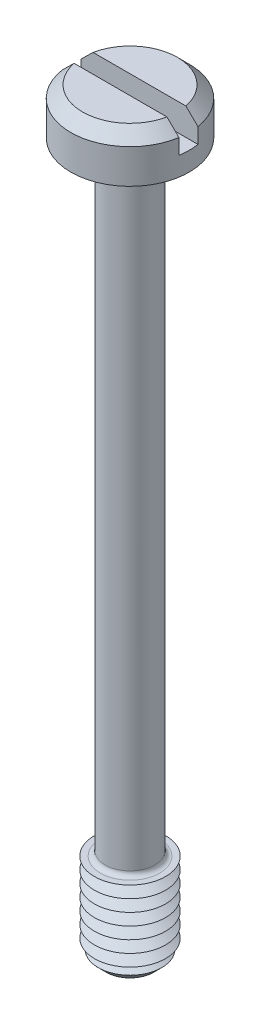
from build123d import *

# Parameters (mm, degrees)
SKETCH1_R           = 5
BOSS_EXTRUDE1_DEPTH = 3.9
SKETCH2_R           = 2.1
BOSS_EXTRUDE2_DEPTH = 60
SKETCH3_R           = 3
BOSS_EXTRUDE3_DEPTH = 7.5
CHAMFER1_SIZE       = 1
LPATTERN1_COUNT     = 7
LPATTERN1_PITCH     = 1
FILLET1_R           = 0.4
CHAMFER2_SIZE       = 1
SKETCH6_W           = 10
SKETCH6_H           = 1.6
CUT_EXTRUDE1_DEPTH  = 2.3


with BuildPart() as part:
    # Sketch1 → Boss-Extrude1 (new body)
    with BuildSketch(Plane(origin=(0, 0, 0), x_dir=(1, 0, 0), z_dir=(0, 1, 0))):
        with Locations(Location((0, 0, 0), (0, 0, 270))):
            Circle(SKETCH1_R)
    extrude(amount=BOSS_EXTRUDE1_DEPTH)

    # Sketch2 → Boss-Extrude2 (add)
    with BuildSketch(Plane.XZ):
        with Locations(Location((0, 0, 0), (0, 0, 270))):
            Circle(SKETCH2_R)
    extrude(amount=BOSS_EXTRUDE2_DEPTH)

    # Sketch3 → Boss-Extrude3 (add)
    with BuildSketch(Plane.XZ.offset(60)):
        with Locations(Location((0, 0, 0), (0, 0, 270))):
            Circle(SKETCH3_R)
    extrude(amount=-BOSS_EXTRUDE3_DEPTH)

    # Chamfer1
    chamfer1_edges = [part.edges().sort_by_distance(p)[0] for p in [
        (0, -60, 3),
    ]]
    chamfer(chamfer1_edges, length=CHAMFER1_SIZE)

    # Sketch5 → Cut-Revolve1 (revolve, cut)
    with BuildSketch(Plane(origin=(0, 0, 0), x_dir=(0, 0, -1), z_dir=(1, 0, 0))):
        Polygon((-3, -52.5), (-2.133974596, -53), (-3, -53.5), align=None)
    cut_revolve1 = revolve(axis=Axis((0, -6.58711856, 0), (0, -1, 0)), mode=Mode.SUBTRACT)

    # LPattern1: Cut-Revolve1 ×7
    with Locations(*[(0, -i * LPATTERN1_PITCH, 0) for i in range(1, LPATTERN1_COUNT)]):
        add(cut_revolve1, mode=Mode.SUBTRACT)

    # Fillet1
    fillet1_edges = [part.edges().sort_by_distance(p)[0] for p in [
        (0, 0, 2.1),
        (0, -52.5, 2.1),
    ]]
    fillet(fillet1_edges, radius=FILLET1_R)

    # Chamfer2
    chamfer2_edges = [part.edges().sort_by_distance(p)[0] for p in [
        (0, 3.9, -5),
    ]]
    chamfer(chamfer2_edges, length=CHAMFER2_SIZE)

    # Sketch6 → Cut-Extrude1 (cut)
    with BuildSketch(Plane(origin=(0, 3.9, 0), x_dir=(1, 0, 0), z_dir=(0, 1, 0))):
        Rectangle(SKETCH6_W, SKETCH6_H)
    extrude(amount=-CUT_EXTRUDE1_DEPTH, mode=Mode.SUBTRACT)


solid = part.part
